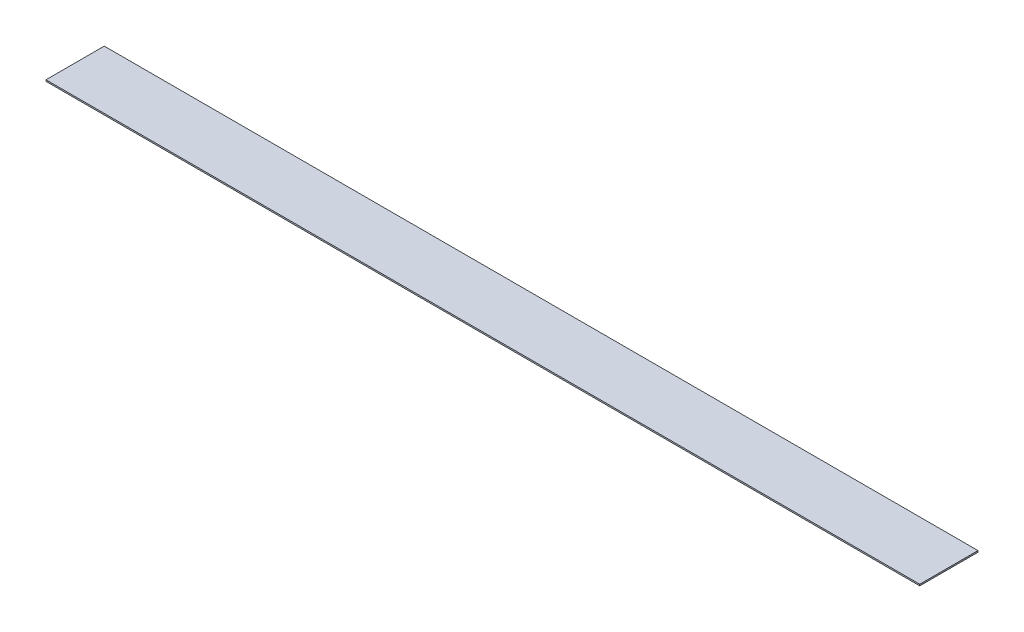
ISO-10303-21;
HEADER;
FILE_DESCRIPTION(('STEP AP214'),'2;1');
FILE_NAME('part.step','',(''),(''),'','','');
FILE_SCHEMA(('AUTOMOTIVE_DESIGN { 1 0 10303 214 1 1 1 1 }'));
ENDSEC;
DATA;
#1=APPLICATION_CONTEXT('core data for automotive mechanical design processes');
#2=APPLICATION_PROTOCOL_DEFINITION('international standard','automotive_design',2000,#1);
#3=PRODUCT_CONTEXT('',#1,'mechanical');
#4=PRODUCT('Part','Part','',(#3));
#5=PRODUCT_RELATED_PRODUCT_CATEGORY('part','',(#4));
#6=PRODUCT_DEFINITION_FORMATION('','',#4);
#7=PRODUCT_DEFINITION_CONTEXT('part definition',#1,'design');
#8=PRODUCT_DEFINITION('design','',#6,#7);
#9=PRODUCT_DEFINITION_SHAPE('','',#8);
#10=(LENGTH_UNIT() NAMED_UNIT(*) SI_UNIT(.MILLI.,.METRE.));
#11=(NAMED_UNIT(*) PLANE_ANGLE_UNIT() SI_UNIT($,.RADIAN.));
#12=(NAMED_UNIT(*) SI_UNIT($,.STERADIAN.) SOLID_ANGLE_UNIT());
#13=UNCERTAINTY_MEASURE_WITH_UNIT(LENGTH_MEASURE(1.E-05),#10,'distance_accuracy_value','');
#14=(GEOMETRIC_REPRESENTATION_CONTEXT(3) GLOBAL_UNCERTAINTY_ASSIGNED_CONTEXT((#13)) GLOBAL_UNIT_ASSIGNED_CONTEXT((#10,
#11,#12)) REPRESENTATION_CONTEXT('',''));
#15=CARTESIAN_POINT('',(0.,0.,0.));
#16=DIRECTION('',(0.,0.,1.));
#17=DIRECTION('',(1.,0.,0.));
#18=AXIS2_PLACEMENT_3D('',#15,#16,#17);
#19=CARTESIAN_POINT('',(0.,10.,-200.));
#20=DIRECTION('',(1.,0.,0.));
#21=DIRECTION('',(0.,0.,-1.));
#22=AXIS2_PLACEMENT_3D('',#19,#20,#21);
#23=PLANE('',#22);
#24=DIRECTION('',(0.,0.,1.));
#25=VECTOR('',#24,1.);
#26=CARTESIAN_POINT('',(0.,0.,-200.));
#27=LINE('',#26,#25);
#28=CARTESIAN_POINT('',(0.,0.,-200.));
#29=VERTEX_POINT('',#28);
#30=CARTESIAN_POINT('',(0.,0.,200.));
#31=VERTEX_POINT('',#30);
#32=EDGE_CURVE('E95',#29,#31,#27,.T.);
#33=ORIENTED_EDGE('',*,*,#32,.T.);
#34=DIRECTION('',(0.,-1.,0.));
#35=VECTOR('',#34,1.);
#36=CARTESIAN_POINT('',(0.,10.,200.));
#37=LINE('',#36,#35);
#38=CARTESIAN_POINT('',(0.,10.,200.));
#39=VERTEX_POINT('',#38);
#40=EDGE_CURVE('E11',#39,#31,#37,.T.);
#41=ORIENTED_EDGE('',*,*,#40,.F.);
#42=DIRECTION('',(0.,0.,1.));
#43=VECTOR('',#42,1.);
#44=CARTESIAN_POINT('',(0.,10.,-200.));
#45=LINE('',#44,#43);
#46=CARTESIAN_POINT('',(0.,10.,-200.));
#47=VERTEX_POINT('',#46);
#48=EDGE_CURVE('E83',#47,#39,#45,.T.);
#49=ORIENTED_EDGE('',*,*,#48,.F.);
#50=DIRECTION('',(0.,-1.,0.));
#51=VECTOR('',#50,1.);
#52=CARTESIAN_POINT('',(0.,10.,-200.));
#53=LINE('',#52,#51);
#54=EDGE_CURVE('E91',#47,#29,#53,.T.);
#55=ORIENTED_EDGE('',*,*,#54,.T.);
#56=EDGE_LOOP('',(#33,#41,#49,#55));
#57=FACE_BOUND('',#56,.T.);
#58=ADVANCED_FACE('F32',(#57),#23,.F.);
#59=CARTESIAN_POINT('',(0.,10.,200.));
#60=DIRECTION('',(0.,0.,-1.));
#61=DIRECTION('',(-1.,0.,0.));
#62=AXIS2_PLACEMENT_3D('',#59,#60,#61);
#63=PLANE('',#62);
#64=DIRECTION('',(1.,0.,0.));
#65=VECTOR('',#64,1.);
#66=CARTESIAN_POINT('',(0.,0.,200.));
#67=LINE('',#66,#65);
#68=CARTESIAN_POINT('',(6000.,0.,200.));
#69=VERTEX_POINT('',#68);
#70=EDGE_CURVE('E87',#31,#69,#67,.T.);
#71=ORIENTED_EDGE('',*,*,#70,.T.);
#72=DIRECTION('',(0.,-1.,0.));
#73=VECTOR('',#72,1.);
#74=CARTESIAN_POINT('',(6000.,10.,200.));
#75=LINE('',#74,#73);
#76=CARTESIAN_POINT('',(6000.,10.,200.));
#77=VERTEX_POINT('',#76);
#78=EDGE_CURVE('E40',#77,#69,#75,.T.);
#79=ORIENTED_EDGE('',*,*,#78,.F.);
#80=DIRECTION('',(1.,0.,0.));
#81=VECTOR('',#80,1.);
#82=CARTESIAN_POINT('',(0.,10.,200.));
#83=LINE('',#82,#81);
#84=EDGE_CURVE('E78',#39,#77,#83,.T.);
#85=ORIENTED_EDGE('',*,*,#84,.F.);
#86=ORIENTED_EDGE('',*,*,#40,.T.);
#87=EDGE_LOOP('',(#71,#79,#85,#86));
#88=FACE_BOUND('',#87,.T.);
#89=ADVANCED_FACE('F86',(#88),#63,.F.);
#90=CARTESIAN_POINT('',(6000.,10.,-200.));
#91=DIRECTION('',(-1.,0.,0.));
#92=DIRECTION('',(0.,0.,1.));
#93=AXIS2_PLACEMENT_3D('',#90,#91,#92);
#94=PLANE('',#93);
#95=DIRECTION('',(0.,0.,-1.));
#96=VECTOR('',#95,1.);
#97=CARTESIAN_POINT('',(6000.,0.,-200.));
#98=LINE('',#97,#96);
#99=CARTESIAN_POINT('',(6000.,0.,-200.));
#100=VERTEX_POINT('',#99);
#101=EDGE_CURVE('E65',#69,#100,#98,.T.);
#102=ORIENTED_EDGE('',*,*,#101,.T.);
#103=DIRECTION('',(0.,-1.,0.));
#104=VECTOR('',#103,1.);
#105=CARTESIAN_POINT('',(6000.,10.,-200.));
#106=LINE('',#105,#104);
#107=CARTESIAN_POINT('',(6000.,10.,-200.));
#108=VERTEX_POINT('',#107);
#109=EDGE_CURVE('E88',#108,#100,#106,.T.);
#110=ORIENTED_EDGE('',*,*,#109,.F.);
#111=DIRECTION('',(0.,0.,-1.));
#112=VECTOR('',#111,1.);
#113=CARTESIAN_POINT('',(6000.,10.,-200.));
#114=LINE('',#113,#112);
#115=EDGE_CURVE('E81',#77,#108,#114,.T.);
#116=ORIENTED_EDGE('',*,*,#115,.F.);
#117=ORIENTED_EDGE('',*,*,#78,.T.);
#118=EDGE_LOOP('',(#102,#110,#116,#117));
#119=FACE_BOUND('',#118,.T.);
#120=ADVANCED_FACE('F89',(#119),#94,.F.);
#121=CARTESIAN_POINT('',(0.,10.,-200.));
#122=DIRECTION('',(0.,0.,1.));
#123=DIRECTION('',(1.,0.,0.));
#124=AXIS2_PLACEMENT_3D('',#121,#122,#123);
#125=PLANE('',#124);
#126=DIRECTION('',(-1.,0.,0.));
#127=VECTOR('',#126,1.);
#128=CARTESIAN_POINT('',(0.,0.,-200.));
#129=LINE('',#128,#127);
#130=EDGE_CURVE('E71',#100,#29,#129,.T.);
#131=ORIENTED_EDGE('',*,*,#130,.T.);
#132=ORIENTED_EDGE('',*,*,#54,.F.);
#133=DIRECTION('',(-1.,0.,0.));
#134=VECTOR('',#133,1.);
#135=CARTESIAN_POINT('',(0.,10.,-200.));
#136=LINE('',#135,#134);
#137=EDGE_CURVE('E48',#108,#47,#136,.T.);
#138=ORIENTED_EDGE('',*,*,#137,.F.);
#139=ORIENTED_EDGE('',*,*,#109,.T.);
#140=EDGE_LOOP('',(#131,#132,#138,#139));
#141=FACE_BOUND('',#140,.T.);
#142=ADVANCED_FACE('F102',(#141),#125,.F.);
#143=CARTESIAN_POINT('',(0.,10.,200.));
#144=DIRECTION('',(0.,1.,0.));
#145=DIRECTION('',(0.,0.,1.));
#146=AXIS2_PLACEMENT_3D('',#143,#144,#145);
#147=PLANE('',#146);
#148=ORIENTED_EDGE('',*,*,#48,.T.);
#149=ORIENTED_EDGE('',*,*,#84,.T.);
#150=ORIENTED_EDGE('',*,*,#115,.T.);
#151=ORIENTED_EDGE('',*,*,#137,.T.);
#152=EDGE_LOOP('',(#148,#149,#150,#151));
#153=FACE_BOUND('',#152,.T.);
#154=ADVANCED_FACE('F79',(#153),#147,.T.);
#155=CARTESIAN_POINT('',(0.,0.,200.));
#156=DIRECTION('',(0.,1.,0.));
#157=DIRECTION('',(0.,0.,1.));
#158=AXIS2_PLACEMENT_3D('',#155,#156,#157);
#159=PLANE('',#158);
#160=ORIENTED_EDGE('',*,*,#32,.F.);
#161=ORIENTED_EDGE('',*,*,#130,.F.);
#162=ORIENTED_EDGE('',*,*,#101,.F.);
#163=ORIENTED_EDGE('',*,*,#70,.F.);
#164=EDGE_LOOP('',(#160,#161,#162,#163));
#165=FACE_BOUND('',#164,.T.);
#166=ADVANCED_FACE('F105',(#165),#159,.F.);
#167=CLOSED_SHELL('',(#58,#89,#120,#142,#154,#166));
#168=MANIFOLD_SOLID_BREP('B2',#167);
#169=ADVANCED_BREP_SHAPE_REPRESENTATION('',(#18,#168),#14);
#170=SHAPE_DEFINITION_REPRESENTATION(#9,#169);
ENDSEC;
END-ISO-10303-21;
